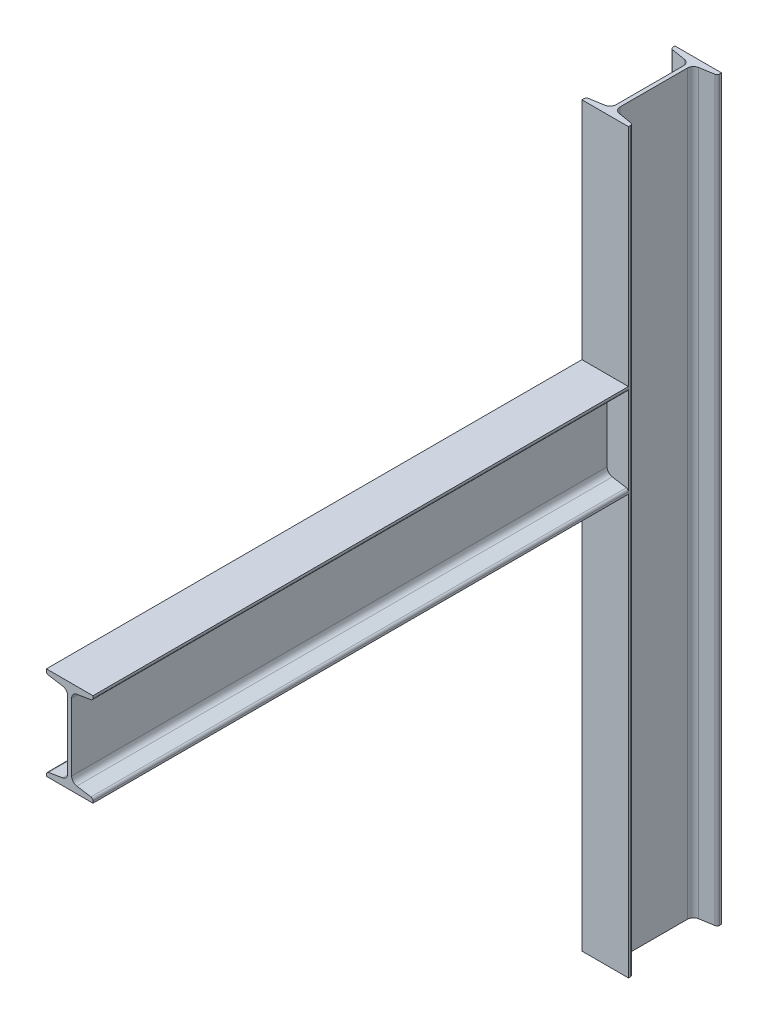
ISO-10303-21;
HEADER;
FILE_DESCRIPTION(('STEP AP214'),'2;1');
FILE_NAME('part.step','',(''),(''),'','','');
FILE_SCHEMA(('AUTOMOTIVE_DESIGN { 1 0 10303 214 1 1 1 1 }'));
ENDSEC;
DATA;
#1=APPLICATION_CONTEXT('core data for automotive mechanical design processes');
#2=APPLICATION_PROTOCOL_DEFINITION('international standard','automotive_design',2000,#1);
#3=PRODUCT_CONTEXT('',#1,'mechanical');
#4=PRODUCT('Part','Part','',(#3));
#5=PRODUCT_RELATED_PRODUCT_CATEGORY('part','',(#4));
#6=PRODUCT_DEFINITION_FORMATION('','',#4);
#7=PRODUCT_DEFINITION_CONTEXT('part definition',#1,'design');
#8=PRODUCT_DEFINITION('design','',#6,#7);
#9=PRODUCT_DEFINITION_SHAPE('','',#8);
#10=(LENGTH_UNIT() NAMED_UNIT(*) SI_UNIT(.MILLI.,.METRE.));
#11=(NAMED_UNIT(*) PLANE_ANGLE_UNIT() SI_UNIT($,.RADIAN.));
#12=(NAMED_UNIT(*) SI_UNIT($,.STERADIAN.) SOLID_ANGLE_UNIT());
#13=UNCERTAINTY_MEASURE_WITH_UNIT(LENGTH_MEASURE(1.E-05),#10,'distance_accuracy_value','');
#14=(GEOMETRIC_REPRESENTATION_CONTEXT(3) GLOBAL_UNCERTAINTY_ASSIGNED_CONTEXT((#13)) GLOBAL_UNIT_ASSIGNED_CONTEXT((#10,
#11,#12)) REPRESENTATION_CONTEXT('',''));
#15=CARTESIAN_POINT('',(0.,0.,0.));
#16=DIRECTION('',(0.,0.,1.));
#17=DIRECTION('',(1.,0.,0.));
#18=AXIS2_PLACEMENT_3D('',#15,#16,#17);
#19=CARTESIAN_POINT('',(-26.825,542.618569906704,750.));
#20=DIRECTION('',(0.,0.,-1.));
#21=DIRECTION('',(0.,1.,0.));
#22=AXIS2_PLACEMENT_3D('',#19,#20,#21);
#23=PLANE('',#22);
#24=DIRECTION('',(1.,0.,0.));
#25=VECTOR('',#24,1.);
#26=CARTESIAN_POINT('',(30.,540.,750.));
#27=LINE('',#26,#25);
#28=CARTESIAN_POINT('',(-30.,540.,750.));
#29=VERTEX_POINT('',#28);
#30=CARTESIAN_POINT('',(30.,540.,750.));
#31=VERTEX_POINT('',#30);
#32=EDGE_CURVE('E306',#29,#31,#27,.T.);
#33=ORIENTED_EDGE('',*,*,#32,.T.);
#34=DIRECTION('',(0.,1.,0.));
#35=VECTOR('',#34,1.);
#36=CARTESIAN_POINT('',(30.,542.618569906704,750.));
#37=LINE('',#36,#35);
#38=CARTESIAN_POINT('',(30.,542.618569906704,750.));
#39=VERTEX_POINT('',#38);
#40=EDGE_CURVE('E322',#31,#39,#37,.T.);
#41=ORIENTED_EDGE('',*,*,#40,.T.);
#42=CARTESIAN_POINT('',(26.825,542.618569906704,750.));
#43=DIRECTION('',(0.,0.,1.));
#44=DIRECTION('',(0.,-1.,0.));
#45=AXIS2_PLACEMENT_3D('',#42,#43,#44);
#46=CIRCLE('',#45,3.17500000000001);
#47=CARTESIAN_POINT('',(27.3470038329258,545.750364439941,750.));
#48=VERTEX_POINT('',#47);
#49=EDGE_CURVE('E330',#39,#48,#46,.T.);
#50=ORIENTED_EDGE('',*,*,#49,.T.);
#51=DIRECTION('',(-0.986391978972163,0.164410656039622,0.));
#52=VECTOR('',#51,1.);
#53=CARTESIAN_POINT('',(9.18471475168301,548.777633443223,750.));
#54=LINE('',#53,#52);
#55=CARTESIAN_POINT('',(9.18471475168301,548.777633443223,750.));
#56=VERTEX_POINT('',#55);
#57=EDGE_CURVE('E335',#48,#56,#54,.T.);
#58=ORIENTED_EDGE('',*,*,#57,.T.);
#59=CARTESIAN_POINT('',(10.5,556.668769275,750.));
#60=DIRECTION('',(0.,0.,-1.));
#61=DIRECTION('',(0.,-1.,0.));
#62=AXIS2_PLACEMENT_3D('',#59,#60,#61);
#63=CIRCLE('',#62,8.);
#64=CARTESIAN_POINT('',(2.49999999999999,556.668769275,750.));
#65=VERTEX_POINT('',#64);
#66=EDGE_CURVE('E340',#56,#65,#63,.T.);
#67=ORIENTED_EDGE('',*,*,#66,.T.);
#68=DIRECTION('',(0.,1.,0.));
#69=VECTOR('',#68,1.);
#70=CARTESIAN_POINT('',(2.49999999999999,643.331230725,750.));
#71=LINE('',#70,#69);
#72=CARTESIAN_POINT('',(2.5,643.331230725,750.));
#73=VERTEX_POINT('',#72);
#74=EDGE_CURVE('E345',#65,#73,#71,.T.);
#75=ORIENTED_EDGE('',*,*,#74,.T.);
#76=CARTESIAN_POINT('',(10.5,643.331230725,750.));
#77=DIRECTION('',(0.,0.,-1.));
#78=DIRECTION('',(0.,-1.,0.));
#79=AXIS2_PLACEMENT_3D('',#76,#77,#78);
#80=CIRCLE('',#79,8.00000000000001);
#81=CARTESIAN_POINT('',(9.18471475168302,651.222366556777,750.));
#82=VERTEX_POINT('',#81);
#83=EDGE_CURVE('E350',#73,#82,#80,.T.);
#84=ORIENTED_EDGE('',*,*,#83,.T.);
#85=DIRECTION('',(0.986391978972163,0.164410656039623,0.));
#86=VECTOR('',#85,1.);
#87=CARTESIAN_POINT('',(27.3470038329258,654.249635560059,750.));
#88=LINE('',#87,#86);
#89=CARTESIAN_POINT('',(27.3470038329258,654.249635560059,750.));
#90=VERTEX_POINT('',#89);
#91=EDGE_CURVE('E355',#82,#90,#88,.T.);
#92=ORIENTED_EDGE('',*,*,#91,.T.);
#93=CARTESIAN_POINT('',(26.825,657.381430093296,750.));
#94=DIRECTION('',(0.,0.,1.));
#95=DIRECTION('',(0.,-1.,0.));
#96=AXIS2_PLACEMENT_3D('',#93,#94,#95);
#97=CIRCLE('',#96,3.175);
#98=CARTESIAN_POINT('',(30.,657.381430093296,750.));
#99=VERTEX_POINT('',#98);
#100=EDGE_CURVE('E360',#90,#99,#97,.T.);
#101=ORIENTED_EDGE('',*,*,#100,.T.);
#102=DIRECTION('',(0.,1.,0.));
#103=VECTOR('',#102,1.);
#104=CARTESIAN_POINT('',(30.,660.,750.));
#105=LINE('',#104,#103);
#106=CARTESIAN_POINT('',(30.,660.,750.));
#107=VERTEX_POINT('',#106);
#108=EDGE_CURVE('E365',#99,#107,#105,.T.);
#109=ORIENTED_EDGE('',*,*,#108,.T.);
#110=DIRECTION('',(-1.,0.,0.));
#111=VECTOR('',#110,1.);
#112=CARTESIAN_POINT('',(-30.,660.,750.));
#113=LINE('',#112,#111);
#114=CARTESIAN_POINT('',(-30.,660.,750.));
#115=VERTEX_POINT('',#114);
#116=EDGE_CURVE('E370',#107,#115,#113,.T.);
#117=ORIENTED_EDGE('',*,*,#116,.T.);
#118=DIRECTION('',(0.,-1.,0.));
#119=VECTOR('',#118,1.);
#120=CARTESIAN_POINT('',(-30.,657.381430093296,750.));
#121=LINE('',#120,#119);
#122=CARTESIAN_POINT('',(-30.,657.381430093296,750.));
#123=VERTEX_POINT('',#122);
#124=EDGE_CURVE('E375',#115,#123,#121,.T.);
#125=ORIENTED_EDGE('',*,*,#124,.T.);
#126=CARTESIAN_POINT('',(-26.825,657.381430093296,750.));
#127=DIRECTION('',(0.,0.,1.));
#128=DIRECTION('',(0.,1.,0.));
#129=AXIS2_PLACEMENT_3D('',#126,#127,#128);
#130=CIRCLE('',#129,3.175);
#131=CARTESIAN_POINT('',(-27.3470038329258,654.249635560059,750.));
#132=VERTEX_POINT('',#131);
#133=EDGE_CURVE('E380',#123,#132,#130,.T.);
#134=ORIENTED_EDGE('',*,*,#133,.T.);
#135=DIRECTION('',(0.986391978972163,-0.164410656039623,0.));
#136=VECTOR('',#135,1.);
#137=CARTESIAN_POINT('',(-9.184714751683,651.222366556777,750.));
#138=LINE('',#137,#136);
#139=CARTESIAN_POINT('',(-9.184714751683,651.222366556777,750.));
#140=VERTEX_POINT('',#139);
#141=EDGE_CURVE('E385',#132,#140,#138,.T.);
#142=ORIENTED_EDGE('',*,*,#141,.T.);
#143=CARTESIAN_POINT('',(-10.5,643.331230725,750.));
#144=DIRECTION('',(0.,0.,-1.));
#145=DIRECTION('',(0.,-1.,0.));
#146=AXIS2_PLACEMENT_3D('',#143,#144,#145);
#147=CIRCLE('',#146,7.99999999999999);
#148=CARTESIAN_POINT('',(-2.50000000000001,643.331230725,750.));
#149=VERTEX_POINT('',#148);
#150=EDGE_CURVE('E390',#140,#149,#147,.T.);
#151=ORIENTED_EDGE('',*,*,#150,.T.);
#152=DIRECTION('',(0.,-1.,0.));
#153=VECTOR('',#152,1.);
#154=CARTESIAN_POINT('',(-2.50000000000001,556.668769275,750.));
#155=LINE('',#154,#153);
#156=CARTESIAN_POINT('',(-2.50000000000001,556.668769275,750.));
#157=VERTEX_POINT('',#156);
#158=EDGE_CURVE('E395',#149,#157,#155,.T.);
#159=ORIENTED_EDGE('',*,*,#158,.T.);
#160=CARTESIAN_POINT('',(-10.5,556.668769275,750.));
#161=DIRECTION('',(0.,0.,-1.));
#162=DIRECTION('',(0.,-1.,0.));
#163=AXIS2_PLACEMENT_3D('',#160,#161,#162);
#164=CIRCLE('',#163,8.);
#165=CARTESIAN_POINT('',(-9.18471475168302,548.777633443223,750.));
#166=VERTEX_POINT('',#165);
#167=EDGE_CURVE('E400',#157,#166,#164,.T.);
#168=ORIENTED_EDGE('',*,*,#167,.T.);
#169=DIRECTION('',(-0.986391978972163,-0.164410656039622,0.));
#170=VECTOR('',#169,1.);
#171=CARTESIAN_POINT('',(-27.3470038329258,545.750364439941,750.));
#172=LINE('',#171,#170);
#173=CARTESIAN_POINT('',(-27.3470038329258,545.750364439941,750.));
#174=VERTEX_POINT('',#173);
#175=EDGE_CURVE('E405',#166,#174,#172,.T.);
#176=ORIENTED_EDGE('',*,*,#175,.T.);
#177=CARTESIAN_POINT('',(-26.825,542.618569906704,750.));
#178=DIRECTION('',(0.,0.,1.));
#179=DIRECTION('',(0.,1.,0.));
#180=AXIS2_PLACEMENT_3D('',#177,#178,#179);
#181=CIRCLE('',#180,3.17499999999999);
#182=CARTESIAN_POINT('',(-30.,542.618569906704,750.));
#183=VERTEX_POINT('',#182);
#184=EDGE_CURVE('E315',#174,#183,#181,.T.);
#185=ORIENTED_EDGE('',*,*,#184,.T.);
#186=DIRECTION('',(0.,-1.,0.));
#187=VECTOR('',#186,1.);
#188=CARTESIAN_POINT('',(-30.,540.,750.));
#189=LINE('',#188,#187);
#190=EDGE_CURVE('E302',#183,#29,#189,.T.);
#191=ORIENTED_EDGE('',*,*,#190,.T.);
#192=EDGE_LOOP('',(#33,#41,#50,#58,#67,#75,#84,#92,#101,#109,#117,#125,#134,#142,#151,#159,#168,
#176,#185,#191));
#193=FACE_BOUND('',#192,.T.);
#194=ADVANCED_FACE('F164',(#193),#23,.F.);
#195=CARTESIAN_POINT('',(30.,540.,0.));
#196=DIRECTION('',(0.,-1.,0.));
#197=DIRECTION('',(1.,0.,0.));
#198=AXIS2_PLACEMENT_3D('',#195,#196,#197);
#199=PLANE('',#198);
#200=DIRECTION('',(-1.,0.,0.));
#201=VECTOR('',#200,1.);
#202=CARTESIAN_POINT('',(30.,540.,60.));
#203=LINE('',#202,#201);
#204=CARTESIAN_POINT('',(30.,540.,60.));
#205=VERTEX_POINT('',#204);
#206=CARTESIAN_POINT('',(-30.,540.,60.));
#207=VERTEX_POINT('',#206);
#208=EDGE_CURVE('E171',#205,#207,#203,.T.);
#209=ORIENTED_EDGE('',*,*,#208,.F.);
#210=DIRECTION('',(0.,0.,1.));
#211=VECTOR('',#210,1.);
#212=CARTESIAN_POINT('',(30.,540.,0.));
#213=LINE('',#212,#211);
#214=EDGE_CURVE('E320',#205,#31,#213,.T.);
#215=ORIENTED_EDGE('',*,*,#214,.T.);
#216=ORIENTED_EDGE('',*,*,#32,.F.);
#217=DIRECTION('',(0.,0.,1.));
#218=VECTOR('',#217,1.);
#219=CARTESIAN_POINT('',(-30.,540.,0.));
#220=LINE('',#219,#218);
#221=EDGE_CURVE('E298',#207,#29,#220,.T.);
#222=ORIENTED_EDGE('',*,*,#221,.F.);
#223=EDGE_LOOP('',(#209,#215,#216,#222));
#224=FACE_BOUND('',#223,.T.);
#225=ADVANCED_FACE('F318',(#224),#199,.T.);
#226=CARTESIAN_POINT('',(30.,542.618569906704,0.));
#227=DIRECTION('',(1.,0.,0.));
#228=DIRECTION('',(0.,1.,0.));
#229=AXIS2_PLACEMENT_3D('',#226,#227,#228);
#230=PLANE('',#229);
#231=DIRECTION('',(0.,-1.,0.));
#232=VECTOR('',#231,1.);
#233=CARTESIAN_POINT('',(30.,542.618569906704,60.));
#234=LINE('',#233,#232);
#235=CARTESIAN_POINT('',(30.,542.618569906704,60.));
#236=VERTEX_POINT('',#235);
#237=EDGE_CURVE('E446',#236,#205,#234,.T.);
#238=ORIENTED_EDGE('',*,*,#237,.F.);
#239=DIRECTION('',(0.,0.,1.));
#240=VECTOR('',#239,1.);
#241=CARTESIAN_POINT('',(30.,542.618569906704,0.));
#242=LINE('',#241,#240);
#243=EDGE_CURVE('E328',#236,#39,#242,.T.);
#244=ORIENTED_EDGE('',*,*,#243,.T.);
#245=ORIENTED_EDGE('',*,*,#40,.F.);
#246=ORIENTED_EDGE('',*,*,#214,.F.);
#247=EDGE_LOOP('',(#238,#244,#245,#246));
#248=FACE_BOUND('',#247,.T.);
#249=ADVANCED_FACE('F449',(#248),#230,.T.);
#250=CARTESIAN_POINT('',(26.825,542.618569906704,0.));
#251=DIRECTION('',(0.,0.,1.));
#252=DIRECTION('',(1.,0.,0.));
#253=AXIS2_PLACEMENT_3D('',#250,#251,#252);
#254=CYLINDRICAL_SURFACE('',#253,3.17500000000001);
#255=CARTESIAN_POINT('',(26.825,542.618569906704,60.));
#256=DIRECTION('',(0.,0.,1.));
#257=DIRECTION('',(1.,0.,0.));
#258=AXIS2_PLACEMENT_3D('',#255,#256,#257);
#259=CIRCLE('',#258,3.17500000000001);
#260=CARTESIAN_POINT('',(27.3470038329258,545.750364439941,60.));
#261=VERTEX_POINT('',#260);
#262=EDGE_CURVE('E178',#261,#236,#259,.F.);
#263=ORIENTED_EDGE('',*,*,#262,.F.);
#264=DIRECTION('',(0.,0.,1.));
#265=VECTOR('',#264,1.);
#266=CARTESIAN_POINT('',(27.3470038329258,545.750364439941,0.));
#267=LINE('',#266,#265);
#268=EDGE_CURVE('E333',#261,#48,#267,.T.);
#269=ORIENTED_EDGE('',*,*,#268,.T.);
#270=ORIENTED_EDGE('',*,*,#49,.F.);
#271=ORIENTED_EDGE('',*,*,#243,.F.);
#272=EDGE_LOOP('',(#263,#269,#270,#271));
#273=FACE_BOUND('',#272,.T.);
#274=ADVANCED_FACE('F454',(#273),#254,.T.);
#275=CARTESIAN_POINT('',(9.18471475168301,548.777633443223,0.));
#276=DIRECTION('',(0.164410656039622,0.986391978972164,0.));
#277=DIRECTION('',(-0.986391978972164,0.164410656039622,0.));
#278=AXIS2_PLACEMENT_3D('',#275,#276,#277);
#279=PLANE('',#278);
#280=DIRECTION('',(0.986391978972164,-0.164410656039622,0.));
#281=VECTOR('',#280,1.);
#282=CARTESIAN_POINT('',(9.18471475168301,548.777633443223,60.));
#283=LINE('',#282,#281);
#284=CARTESIAN_POINT('',(9.184714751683,548.777633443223,60.));
#285=VERTEX_POINT('',#284);
#286=EDGE_CURVE('E183',#285,#261,#283,.T.);
#287=ORIENTED_EDGE('',*,*,#286,.F.);
#288=DIRECTION('',(0.,0.,1.));
#289=VECTOR('',#288,1.);
#290=CARTESIAN_POINT('',(9.18471475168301,548.777633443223,0.));
#291=LINE('',#290,#289);
#292=EDGE_CURVE('E338',#285,#56,#291,.T.);
#293=ORIENTED_EDGE('',*,*,#292,.T.);
#294=ORIENTED_EDGE('',*,*,#57,.F.);
#295=ORIENTED_EDGE('',*,*,#268,.F.);
#296=EDGE_LOOP('',(#287,#293,#294,#295));
#297=FACE_BOUND('',#296,.T.);
#298=ADVANCED_FACE('F457',(#297),#279,.T.);
#299=CARTESIAN_POINT('',(10.5,556.668769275,0.));
#300=DIRECTION('',(0.,0.,1.));
#301=DIRECTION('',(1.,0.,0.));
#302=AXIS2_PLACEMENT_3D('',#299,#300,#301);
#303=CYLINDRICAL_SURFACE('',#302,8.);
#304=CARTESIAN_POINT('',(10.5,556.668769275,60.));
#305=DIRECTION('',(0.,0.,1.));
#306=DIRECTION('',(1.,0.,0.));
#307=AXIS2_PLACEMENT_3D('',#304,#305,#306);
#308=CIRCLE('',#307,8.);
#309=CARTESIAN_POINT('',(2.49999999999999,556.668769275,60.));
#310=VERTEX_POINT('',#309);
#311=EDGE_CURVE('E443',#310,#285,#308,.T.);
#312=ORIENTED_EDGE('',*,*,#311,.F.);
#313=DIRECTION('',(0.,0.,1.));
#314=VECTOR('',#313,1.);
#315=CARTESIAN_POINT('',(2.49999999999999,556.668769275,0.));
#316=LINE('',#315,#314);
#317=EDGE_CURVE('E343',#310,#65,#316,.T.);
#318=ORIENTED_EDGE('',*,*,#317,.T.);
#319=ORIENTED_EDGE('',*,*,#66,.F.);
#320=ORIENTED_EDGE('',*,*,#292,.F.);
#321=EDGE_LOOP('',(#312,#318,#319,#320));
#322=FACE_BOUND('',#321,.T.);
#323=ADVANCED_FACE('F463',(#322),#303,.F.);
#324=CARTESIAN_POINT('',(2.49999999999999,643.331230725,0.));
#325=DIRECTION('',(1.,0.,0.));
#326=DIRECTION('',(0.,0.,-1.));
#327=AXIS2_PLACEMENT_3D('',#324,#325,#326);
#328=PLANE('',#327);
#329=DIRECTION('',(0.,-1.,0.));
#330=VECTOR('',#329,1.);
#331=CARTESIAN_POINT('',(2.49999999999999,643.331230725,60.));
#332=LINE('',#331,#330);
#333=CARTESIAN_POINT('',(2.5,643.331230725,60.));
#334=VERTEX_POINT('',#333);
#335=EDGE_CURVE('E441',#334,#310,#332,.T.);
#336=ORIENTED_EDGE('',*,*,#335,.F.);
#337=DIRECTION('',(0.,0.,1.));
#338=VECTOR('',#337,1.);
#339=CARTESIAN_POINT('',(2.5,643.331230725,0.));
#340=LINE('',#339,#338);
#341=EDGE_CURVE('E348',#334,#73,#340,.T.);
#342=ORIENTED_EDGE('',*,*,#341,.T.);
#343=ORIENTED_EDGE('',*,*,#74,.F.);
#344=ORIENTED_EDGE('',*,*,#317,.F.);
#345=EDGE_LOOP('',(#336,#342,#343,#344));
#346=FACE_BOUND('',#345,.T.);
#347=ADVANCED_FACE('F467',(#346),#328,.T.);
#348=CARTESIAN_POINT('',(10.5,643.331230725,0.));
#349=DIRECTION('',(0.,0.,1.));
#350=DIRECTION('',(1.,0.,0.));
#351=AXIS2_PLACEMENT_3D('',#348,#349,#350);
#352=CYLINDRICAL_SURFACE('',#351,8.00000000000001);
#353=CARTESIAN_POINT('',(10.5,643.331230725,60.));
#354=DIRECTION('',(0.,0.,1.));
#355=DIRECTION('',(1.,0.,0.));
#356=AXIS2_PLACEMENT_3D('',#353,#354,#355);
#357=CIRCLE('',#356,8.00000000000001);
#358=CARTESIAN_POINT('',(9.18471475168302,651.222366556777,60.));
#359=VERTEX_POINT('',#358);
#360=EDGE_CURVE('E439',#359,#334,#357,.T.);
#361=ORIENTED_EDGE('',*,*,#360,.F.);
#362=DIRECTION('',(0.,0.,1.));
#363=VECTOR('',#362,1.);
#364=CARTESIAN_POINT('',(9.18471475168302,651.222366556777,0.));
#365=LINE('',#364,#363);
#366=EDGE_CURVE('E353',#359,#82,#365,.T.);
#367=ORIENTED_EDGE('',*,*,#366,.T.);
#368=ORIENTED_EDGE('',*,*,#83,.F.);
#369=ORIENTED_EDGE('',*,*,#341,.F.);
#370=EDGE_LOOP('',(#361,#367,#368,#369));
#371=FACE_BOUND('',#370,.T.);
#372=ADVANCED_FACE('F473',(#371),#352,.F.);
#373=CARTESIAN_POINT('',(27.3470038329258,654.249635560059,0.));
#374=DIRECTION('',(0.164410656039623,-0.986391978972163,0.));
#375=DIRECTION('',(0.986391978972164,0.164410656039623,0.));
#376=AXIS2_PLACEMENT_3D('',#373,#374,#375);
#377=PLANE('',#376);
#378=DIRECTION('',(-0.986391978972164,-0.164410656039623,0.));
#379=VECTOR('',#378,1.);
#380=CARTESIAN_POINT('',(27.3470038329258,654.249635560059,60.));
#381=LINE('',#380,#379);
#382=CARTESIAN_POINT('',(27.3470038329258,654.249635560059,60.));
#383=VERTEX_POINT('',#382);
#384=EDGE_CURVE('E437',#383,#359,#381,.T.);
#385=ORIENTED_EDGE('',*,*,#384,.F.);
#386=DIRECTION('',(0.,0.,1.));
#387=VECTOR('',#386,1.);
#388=CARTESIAN_POINT('',(27.3470038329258,654.249635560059,0.));
#389=LINE('',#388,#387);
#390=EDGE_CURVE('E358',#383,#90,#389,.T.);
#391=ORIENTED_EDGE('',*,*,#390,.T.);
#392=ORIENTED_EDGE('',*,*,#91,.F.);
#393=ORIENTED_EDGE('',*,*,#366,.F.);
#394=EDGE_LOOP('',(#385,#391,#392,#393));
#395=FACE_BOUND('',#394,.T.);
#396=ADVANCED_FACE('F477',(#395),#377,.T.);
#397=CARTESIAN_POINT('',(26.825,657.381430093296,0.));
#398=DIRECTION('',(0.,0.,1.));
#399=DIRECTION('',(1.,0.,0.));
#400=AXIS2_PLACEMENT_3D('',#397,#398,#399);
#401=CYLINDRICAL_SURFACE('',#400,3.175);
#402=CARTESIAN_POINT('',(26.825,657.381430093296,60.));
#403=DIRECTION('',(0.,0.,1.));
#404=DIRECTION('',(1.,0.,0.));
#405=AXIS2_PLACEMENT_3D('',#402,#403,#404);
#406=CIRCLE('',#405,3.175);
#407=CARTESIAN_POINT('',(30.,657.381430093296,60.));
#408=VERTEX_POINT('',#407);
#409=EDGE_CURVE('E435',#408,#383,#406,.F.);
#410=ORIENTED_EDGE('',*,*,#409,.F.);
#411=DIRECTION('',(0.,0.,1.));
#412=VECTOR('',#411,1.);
#413=CARTESIAN_POINT('',(30.,657.381430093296,0.));
#414=LINE('',#413,#412);
#415=EDGE_CURVE('E363',#408,#99,#414,.T.);
#416=ORIENTED_EDGE('',*,*,#415,.T.);
#417=ORIENTED_EDGE('',*,*,#100,.F.);
#418=ORIENTED_EDGE('',*,*,#390,.F.);
#419=EDGE_LOOP('',(#410,#416,#417,#418));
#420=FACE_BOUND('',#419,.T.);
#421=ADVANCED_FACE('F483',(#420),#401,.T.);
#422=CARTESIAN_POINT('',(30.,660.,0.));
#423=DIRECTION('',(1.,0.,0.));
#424=DIRECTION('',(0.,0.,-1.));
#425=AXIS2_PLACEMENT_3D('',#422,#423,#424);
#426=PLANE('',#425);
#427=DIRECTION('',(0.,-1.,0.));
#428=VECTOR('',#427,1.);
#429=CARTESIAN_POINT('',(30.,660.,60.));
#430=LINE('',#429,#428);
#431=CARTESIAN_POINT('',(30.,660.,60.));
#432=VERTEX_POINT('',#431);
#433=EDGE_CURVE('E433',#432,#408,#430,.T.);
#434=ORIENTED_EDGE('',*,*,#433,.F.);
#435=DIRECTION('',(0.,0.,1.));
#436=VECTOR('',#435,1.);
#437=CARTESIAN_POINT('',(30.,660.,0.));
#438=LINE('',#437,#436);
#439=EDGE_CURVE('E368',#432,#107,#438,.T.);
#440=ORIENTED_EDGE('',*,*,#439,.T.);
#441=ORIENTED_EDGE('',*,*,#108,.F.);
#442=ORIENTED_EDGE('',*,*,#415,.F.);
#443=EDGE_LOOP('',(#434,#440,#441,#442));
#444=FACE_BOUND('',#443,.T.);
#445=ADVANCED_FACE('F487',(#444),#426,.T.);
#446=CARTESIAN_POINT('',(-30.,660.,0.));
#447=DIRECTION('',(0.,1.,0.));
#448=DIRECTION('',(-1.,0.,0.));
#449=AXIS2_PLACEMENT_3D('',#446,#447,#448);
#450=PLANE('',#449);
#451=DIRECTION('',(1.,0.,0.));
#452=VECTOR('',#451,1.);
#453=CARTESIAN_POINT('',(-30.,660.,60.));
#454=LINE('',#453,#452);
#455=CARTESIAN_POINT('',(-30.,660.,60.));
#456=VERTEX_POINT('',#455);
#457=EDGE_CURVE('E431',#456,#432,#454,.T.);
#458=ORIENTED_EDGE('',*,*,#457,.F.);
#459=DIRECTION('',(0.,0.,1.));
#460=VECTOR('',#459,1.);
#461=CARTESIAN_POINT('',(-30.,660.,0.));
#462=LINE('',#461,#460);
#463=EDGE_CURVE('E373',#456,#115,#462,.T.);
#464=ORIENTED_EDGE('',*,*,#463,.T.);
#465=ORIENTED_EDGE('',*,*,#116,.F.);
#466=ORIENTED_EDGE('',*,*,#439,.F.);
#467=EDGE_LOOP('',(#458,#464,#465,#466));
#468=FACE_BOUND('',#467,.T.);
#469=ADVANCED_FACE('F493',(#468),#450,.T.);
#470=CARTESIAN_POINT('',(-30.,657.381430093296,0.));
#471=DIRECTION('',(-1.,0.,0.));
#472=DIRECTION('',(0.,0.,1.));
#473=AXIS2_PLACEMENT_3D('',#470,#471,#472);
#474=PLANE('',#473);
#475=DIRECTION('',(0.,1.,0.));
#476=VECTOR('',#475,1.);
#477=CARTESIAN_POINT('',(-30.,657.381430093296,60.));
#478=LINE('',#477,#476);
#479=CARTESIAN_POINT('',(-30.,657.381430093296,60.));
#480=VERTEX_POINT('',#479);
#481=EDGE_CURVE('E429',#480,#456,#478,.T.);
#482=ORIENTED_EDGE('',*,*,#481,.F.);
#483=DIRECTION('',(0.,0.,1.));
#484=VECTOR('',#483,1.);
#485=CARTESIAN_POINT('',(-30.,657.381430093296,0.));
#486=LINE('',#485,#484);
#487=EDGE_CURVE('E378',#480,#123,#486,.T.);
#488=ORIENTED_EDGE('',*,*,#487,.T.);
#489=ORIENTED_EDGE('',*,*,#124,.F.);
#490=ORIENTED_EDGE('',*,*,#463,.F.);
#491=EDGE_LOOP('',(#482,#488,#489,#490));
#492=FACE_BOUND('',#491,.T.);
#493=ADVANCED_FACE('F497',(#492),#474,.T.);
#494=CARTESIAN_POINT('',(-26.825,657.381430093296,0.));
#495=DIRECTION('',(0.,0.,1.));
#496=DIRECTION('',(1.,0.,0.));
#497=AXIS2_PLACEMENT_3D('',#494,#495,#496);
#498=CYLINDRICAL_SURFACE('',#497,3.175);
#499=CARTESIAN_POINT('',(-26.825,657.381430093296,60.));
#500=DIRECTION('',(0.,0.,1.));
#501=DIRECTION('',(1.,0.,0.));
#502=AXIS2_PLACEMENT_3D('',#499,#500,#501);
#503=CIRCLE('',#502,3.175);
#504=CARTESIAN_POINT('',(-27.3470038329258,654.249635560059,60.));
#505=VERTEX_POINT('',#504);
#506=EDGE_CURVE('E427',#505,#480,#503,.F.);
#507=ORIENTED_EDGE('',*,*,#506,.F.);
#508=DIRECTION('',(0.,0.,1.));
#509=VECTOR('',#508,1.);
#510=CARTESIAN_POINT('',(-27.3470038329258,654.249635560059,0.));
#511=LINE('',#510,#509);
#512=EDGE_CURVE('E383',#505,#132,#511,.T.);
#513=ORIENTED_EDGE('',*,*,#512,.T.);
#514=ORIENTED_EDGE('',*,*,#133,.F.);
#515=ORIENTED_EDGE('',*,*,#487,.F.);
#516=EDGE_LOOP('',(#507,#513,#514,#515));
#517=FACE_BOUND('',#516,.T.);
#518=ADVANCED_FACE('F503',(#517),#498,.T.);
#519=CARTESIAN_POINT('',(-9.184714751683,651.222366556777,0.));
#520=DIRECTION('',(-0.164410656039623,-0.986391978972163,0.));
#521=DIRECTION('',(0.986391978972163,-0.164410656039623,0.));
#522=AXIS2_PLACEMENT_3D('',#519,#520,#521);
#523=PLANE('',#522);
#524=DIRECTION('',(-0.986391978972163,0.164410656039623,0.));
#525=VECTOR('',#524,1.);
#526=CARTESIAN_POINT('',(-9.184714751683,651.222366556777,60.));
#527=LINE('',#526,#525);
#528=CARTESIAN_POINT('',(-9.18471475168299,651.222366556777,60.));
#529=VERTEX_POINT('',#528);
#530=EDGE_CURVE('E425',#529,#505,#527,.T.);
#531=ORIENTED_EDGE('',*,*,#530,.F.);
#532=DIRECTION('',(0.,0.,1.));
#533=VECTOR('',#532,1.);
#534=CARTESIAN_POINT('',(-9.184714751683,651.222366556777,0.));
#535=LINE('',#534,#533);
#536=EDGE_CURVE('E388',#529,#140,#535,.T.);
#537=ORIENTED_EDGE('',*,*,#536,.T.);
#538=ORIENTED_EDGE('',*,*,#141,.F.);
#539=ORIENTED_EDGE('',*,*,#512,.F.);
#540=EDGE_LOOP('',(#531,#537,#538,#539));
#541=FACE_BOUND('',#540,.T.);
#542=ADVANCED_FACE('F507',(#541),#523,.T.);
#543=CARTESIAN_POINT('',(-10.5,643.331230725,0.));
#544=DIRECTION('',(0.,0.,1.));
#545=DIRECTION('',(1.,0.,0.));
#546=AXIS2_PLACEMENT_3D('',#543,#544,#545);
#547=CYLINDRICAL_SURFACE('',#546,7.99999999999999);
#548=CARTESIAN_POINT('',(-10.5,643.331230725,60.));
#549=DIRECTION('',(0.,0.,1.));
#550=DIRECTION('',(1.,0.,0.));
#551=AXIS2_PLACEMENT_3D('',#548,#549,#550);
#552=CIRCLE('',#551,7.99999999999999);
#553=CARTESIAN_POINT('',(-2.50000000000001,643.331230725,60.));
#554=VERTEX_POINT('',#553);
#555=EDGE_CURVE('E423',#554,#529,#552,.T.);
#556=ORIENTED_EDGE('',*,*,#555,.F.);
#557=DIRECTION('',(0.,0.,1.));
#558=VECTOR('',#557,1.);
#559=CARTESIAN_POINT('',(-2.50000000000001,643.331230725,0.));
#560=LINE('',#559,#558);
#561=EDGE_CURVE('E393',#554,#149,#560,.T.);
#562=ORIENTED_EDGE('',*,*,#561,.T.);
#563=ORIENTED_EDGE('',*,*,#150,.F.);
#564=ORIENTED_EDGE('',*,*,#536,.F.);
#565=EDGE_LOOP('',(#556,#562,#563,#564));
#566=FACE_BOUND('',#565,.T.);
#567=ADVANCED_FACE('F513',(#566),#547,.F.);
#568=CARTESIAN_POINT('',(-2.50000000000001,556.668769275,0.));
#569=DIRECTION('',(-1.,0.,0.));
#570=DIRECTION('',(0.,0.,1.));
#571=AXIS2_PLACEMENT_3D('',#568,#569,#570);
#572=PLANE('',#571);
#573=DIRECTION('',(0.,1.,0.));
#574=VECTOR('',#573,1.);
#575=CARTESIAN_POINT('',(-2.50000000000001,556.668769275,60.));
#576=LINE('',#575,#574);
#577=CARTESIAN_POINT('',(-2.50000000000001,556.668769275,60.));
#578=VERTEX_POINT('',#577);
#579=EDGE_CURVE('E421',#578,#554,#576,.T.);
#580=ORIENTED_EDGE('',*,*,#579,.F.);
#581=DIRECTION('',(0.,0.,1.));
#582=VECTOR('',#581,1.);
#583=CARTESIAN_POINT('',(-2.50000000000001,556.668769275,0.));
#584=LINE('',#583,#582);
#585=EDGE_CURVE('E398',#578,#157,#584,.T.);
#586=ORIENTED_EDGE('',*,*,#585,.T.);
#587=ORIENTED_EDGE('',*,*,#158,.F.);
#588=ORIENTED_EDGE('',*,*,#561,.F.);
#589=EDGE_LOOP('',(#580,#586,#587,#588));
#590=FACE_BOUND('',#589,.T.);
#591=ADVANCED_FACE('F517',(#590),#572,.T.);
#592=CARTESIAN_POINT('',(-10.5,556.668769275,0.));
#593=DIRECTION('',(0.,0.,1.));
#594=DIRECTION('',(1.,0.,0.));
#595=AXIS2_PLACEMENT_3D('',#592,#593,#594);
#596=CYLINDRICAL_SURFACE('',#595,8.);
#597=CARTESIAN_POINT('',(-10.5,556.668769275,60.));
#598=DIRECTION('',(0.,0.,1.));
#599=DIRECTION('',(1.,0.,0.));
#600=AXIS2_PLACEMENT_3D('',#597,#598,#599);
#601=CIRCLE('',#600,8.);
#602=CARTESIAN_POINT('',(-9.18471475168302,548.777633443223,60.));
#603=VERTEX_POINT('',#602);
#604=EDGE_CURVE('E417',#603,#578,#601,.T.);
#605=ORIENTED_EDGE('',*,*,#604,.F.);
#606=DIRECTION('',(0.,0.,1.));
#607=VECTOR('',#606,1.);
#608=CARTESIAN_POINT('',(-9.18471475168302,548.777633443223,0.));
#609=LINE('',#608,#607);
#610=EDGE_CURVE('E403',#603,#166,#609,.T.);
#611=ORIENTED_EDGE('',*,*,#610,.T.);
#612=ORIENTED_EDGE('',*,*,#167,.F.);
#613=ORIENTED_EDGE('',*,*,#585,.F.);
#614=EDGE_LOOP('',(#605,#611,#612,#613));
#615=FACE_BOUND('',#614,.T.);
#616=ADVANCED_FACE('F523',(#615),#596,.F.);
#617=CARTESIAN_POINT('',(-27.3470038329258,545.750364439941,0.));
#618=DIRECTION('',(-0.164410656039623,0.986391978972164,0.));
#619=DIRECTION('',(-0.986391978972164,-0.164410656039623,0.));
#620=AXIS2_PLACEMENT_3D('',#617,#618,#619);
#621=PLANE('',#620);
#622=DIRECTION('',(0.986391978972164,0.164410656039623,0.));
#623=VECTOR('',#622,1.);
#624=CARTESIAN_POINT('',(-27.3470038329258,545.750364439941,60.));
#625=LINE('',#624,#623);
#626=CARTESIAN_POINT('',(-27.3470038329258,545.750364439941,60.));
#627=VERTEX_POINT('',#626);
#628=EDGE_CURVE('E415',#627,#603,#625,.T.);
#629=ORIENTED_EDGE('',*,*,#628,.F.);
#630=DIRECTION('',(0.,0.,1.));
#631=VECTOR('',#630,1.);
#632=CARTESIAN_POINT('',(-27.3470038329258,545.750364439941,0.));
#633=LINE('',#632,#631);
#634=EDGE_CURVE('E407',#627,#174,#633,.T.);
#635=ORIENTED_EDGE('',*,*,#634,.T.);
#636=ORIENTED_EDGE('',*,*,#175,.F.);
#637=ORIENTED_EDGE('',*,*,#610,.F.);
#638=EDGE_LOOP('',(#629,#635,#636,#637));
#639=FACE_BOUND('',#638,.T.);
#640=ADVANCED_FACE('F526',(#639),#621,.T.);
#641=CARTESIAN_POINT('',(-26.825,542.618569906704,0.));
#642=DIRECTION('',(0.,0.,1.));
#643=DIRECTION('',(1.,0.,0.));
#644=AXIS2_PLACEMENT_3D('',#641,#642,#643);
#645=CYLINDRICAL_SURFACE('',#644,3.17499999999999);
#646=CARTESIAN_POINT('',(-26.825,542.618569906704,60.));
#647=DIRECTION('',(0.,0.,1.));
#648=DIRECTION('',(1.,0.,0.));
#649=AXIS2_PLACEMENT_3D('',#646,#647,#648);
#650=CIRCLE('',#649,3.17499999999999);
#651=CARTESIAN_POINT('',(-30.,542.618569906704,60.));
#652=VERTEX_POINT('',#651);
#653=EDGE_CURVE('E316',#652,#627,#650,.F.);
#654=ORIENTED_EDGE('',*,*,#653,.F.);
#655=DIRECTION('',(0.,0.,1.));
#656=VECTOR('',#655,1.);
#657=CARTESIAN_POINT('',(-30.,542.618569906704,0.));
#658=LINE('',#657,#656);
#659=EDGE_CURVE('E317',#652,#183,#658,.T.);
#660=ORIENTED_EDGE('',*,*,#659,.T.);
#661=ORIENTED_EDGE('',*,*,#184,.F.);
#662=ORIENTED_EDGE('',*,*,#634,.F.);
#663=EDGE_LOOP('',(#654,#660,#661,#662));
#664=FACE_BOUND('',#663,.T.);
#665=ADVANCED_FACE('F412',(#664),#645,.T.);
#666=CARTESIAN_POINT('',(-30.,540.,0.));
#667=DIRECTION('',(-1.,0.,0.));
#668=DIRECTION('',(0.,0.,1.));
#669=AXIS2_PLACEMENT_3D('',#666,#667,#668);
#670=PLANE('',#669);
#671=DIRECTION('',(0.,1.,0.));
#672=VECTOR('',#671,1.);
#673=CARTESIAN_POINT('',(-30.,540.,60.));
#674=LINE('',#673,#672);
#675=EDGE_CURVE('E13',#207,#652,#674,.T.);
#676=ORIENTED_EDGE('',*,*,#675,.F.);
#677=ORIENTED_EDGE('',*,*,#221,.T.);
#678=ORIENTED_EDGE('',*,*,#190,.F.);
#679=ORIENTED_EDGE('',*,*,#659,.F.);
#680=EDGE_LOOP('',(#676,#677,#678,#679));
#681=FACE_BOUND('',#680,.T.);
#682=ADVANCED_FACE('F300',(#681),#670,.T.);
#683=CARTESIAN_POINT('',(0.,600.,60.));
#684=DIRECTION('',(0.,0.,1.));
#685=DIRECTION('',(1.,0.,0.));
#686=AXIS2_PLACEMENT_3D('',#683,#684,#685);
#687=PLANE('',#686);
#688=ORIENTED_EDGE('',*,*,#208,.T.);
#689=ORIENTED_EDGE('',*,*,#675,.T.);
#690=ORIENTED_EDGE('',*,*,#653,.T.);
#691=ORIENTED_EDGE('',*,*,#628,.T.);
#692=ORIENTED_EDGE('',*,*,#604,.T.);
#693=ORIENTED_EDGE('',*,*,#579,.T.);
#694=ORIENTED_EDGE('',*,*,#555,.T.);
#695=ORIENTED_EDGE('',*,*,#530,.T.);
#696=ORIENTED_EDGE('',*,*,#506,.T.);
#697=ORIENTED_EDGE('',*,*,#481,.T.);
#698=ORIENTED_EDGE('',*,*,#457,.T.);
#699=ORIENTED_EDGE('',*,*,#433,.T.);
#700=ORIENTED_EDGE('',*,*,#409,.T.);
#701=ORIENTED_EDGE('',*,*,#384,.T.);
#702=ORIENTED_EDGE('',*,*,#360,.T.);
#703=ORIENTED_EDGE('',*,*,#335,.T.);
#704=ORIENTED_EDGE('',*,*,#311,.T.);
#705=ORIENTED_EDGE('',*,*,#286,.T.);
#706=ORIENTED_EDGE('',*,*,#262,.T.);
#707=ORIENTED_EDGE('',*,*,#237,.T.);
#708=EDGE_LOOP('',(#688,#689,#690,#691,#692,#693,#694,#695,#696,#697,#698,#699,#700,#701,#702,
#703,#704,#705,#706,#707));
#709=FACE_BOUND('',#708,.T.);
#710=ADVANCED_FACE('F447',(#709),#687,.F.);
#711=CLOSED_SHELL('',(#194,#225,#249,#274,#298,#323,#347,#372,#396,#421,#445,#469,#493,#518,
#542,#567,#591,#616,#640,#665,#682,#710));
#712=MANIFOLD_SOLID_BREP('B2',#711);
#713=CARTESIAN_POINT('',(-26.825,0.,-57.3814300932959));
#714=DIRECTION('',(0.,1.,0.));
#715=DIRECTION('',(0.,0.,1.));
#716=AXIS2_PLACEMENT_3D('',#713,#714,#715);
#717=PLANE('',#716);
#718=DIRECTION('',(1.,0.,0.));
#719=VECTOR('',#718,1.);
#720=CARTESIAN_POINT('',(30.,0.,-60.));
#721=LINE('',#720,#719);
#722=CARTESIAN_POINT('',(-30.,0.,-60.));
#723=VERTEX_POINT('',#722);
#724=CARTESIAN_POINT('',(30.,0.,-60.));
#725=VERTEX_POINT('',#724);
#726=EDGE_CURVE('E1000',#723,#725,#721,.T.);
#727=ORIENTED_EDGE('',*,*,#726,.T.);
#728=DIRECTION('',(0.,0.,1.));
#729=VECTOR('',#728,1.);
#730=CARTESIAN_POINT('',(30.,0.,-57.3814300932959));
#731=LINE('',#730,#729);
#732=CARTESIAN_POINT('',(30.,0.,-57.3814300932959));
#733=VERTEX_POINT('',#732);
#734=EDGE_CURVE('E1007',#725,#733,#731,.T.);
#735=ORIENTED_EDGE('',*,*,#734,.T.);
#736=CARTESIAN_POINT('',(26.825,0.,-57.3814300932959));
#737=DIRECTION('',(0.,-1.,0.));
#738=DIRECTION('',(0.,0.,-1.));
#739=AXIS2_PLACEMENT_3D('',#736,#737,#738);
#740=CIRCLE('',#739,3.17500000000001);
#741=CARTESIAN_POINT('',(27.3470038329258,0.,-54.2496355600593));
#742=VERTEX_POINT('',#741);
#743=EDGE_CURVE('E1017',#733,#742,#740,.T.);
#744=ORIENTED_EDGE('',*,*,#743,.T.);
#745=DIRECTION('',(-0.986391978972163,0.,0.164410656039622));
#746=VECTOR('',#745,1.);
#747=CARTESIAN_POINT('',(9.18471475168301,0.,-51.2223665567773));
#748=LINE('',#747,#746);
#749=CARTESIAN_POINT('',(9.18471475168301,0.,-51.2223665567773));
#750=VERTEX_POINT('',#749);
#751=EDGE_CURVE('E1026',#742,#750,#748,.T.);
#752=ORIENTED_EDGE('',*,*,#751,.T.);
#753=CARTESIAN_POINT('',(10.5,0.,-43.331230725));
#754=DIRECTION('',(0.,1.,0.));
#755=DIRECTION('',(0.,0.,-1.));
#756=AXIS2_PLACEMENT_3D('',#753,#754,#755);
#757=CIRCLE('',#756,8.);
#758=CARTESIAN_POINT('',(2.49999999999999,0.,-43.331230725));
#759=VERTEX_POINT('',#758);
#760=EDGE_CURVE('E1034',#750,#759,#757,.T.);
#761=ORIENTED_EDGE('',*,*,#760,.T.);
#762=DIRECTION('',(0.,0.,1.));
#763=VECTOR('',#762,1.);
#764=CARTESIAN_POINT('',(2.49999999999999,0.,43.331230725));
#765=LINE('',#764,#763);
#766=CARTESIAN_POINT('',(2.5,0.,43.331230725));
#767=VERTEX_POINT('',#766);
#768=EDGE_CURVE('E1042',#759,#767,#765,.T.);
#769=ORIENTED_EDGE('',*,*,#768,.T.);
#770=CARTESIAN_POINT('',(10.5,0.,43.331230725));
#771=DIRECTION('',(0.,1.,0.));
#772=DIRECTION('',(0.,0.,-1.));
#773=AXIS2_PLACEMENT_3D('',#770,#771,#772);
#774=CIRCLE('',#773,8.00000000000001);
#775=CARTESIAN_POINT('',(9.18471475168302,0.,51.2223665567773));
#776=VERTEX_POINT('',#775);
#777=EDGE_CURVE('E1050',#767,#776,#774,.T.);
#778=ORIENTED_EDGE('',*,*,#777,.T.);
#779=DIRECTION('',(0.986391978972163,0.,0.164410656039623));
#780=VECTOR('',#779,1.);
#781=CARTESIAN_POINT('',(27.3470038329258,0.,54.2496355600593));
#782=LINE('',#781,#780);
#783=CARTESIAN_POINT('',(27.3470038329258,0.,54.2496355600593));
#784=VERTEX_POINT('',#783);
#785=EDGE_CURVE('E1058',#776,#784,#782,.T.);
#786=ORIENTED_EDGE('',*,*,#785,.T.);
#787=CARTESIAN_POINT('',(26.825,0.,57.3814300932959));
#788=DIRECTION('',(0.,-1.,0.));
#789=DIRECTION('',(0.,0.,-1.));
#790=AXIS2_PLACEMENT_3D('',#787,#788,#789);
#791=CIRCLE('',#790,3.175);
#792=CARTESIAN_POINT('',(30.,0.,57.3814300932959));
#793=VERTEX_POINT('',#792);
#794=EDGE_CURVE('E1066',#784,#793,#791,.T.);
#795=ORIENTED_EDGE('',*,*,#794,.T.);
#796=DIRECTION('',(0.,0.,1.));
#797=VECTOR('',#796,1.);
#798=CARTESIAN_POINT('',(30.,0.,60.));
#799=LINE('',#798,#797);
#800=CARTESIAN_POINT('',(30.,0.,60.));
#801=VERTEX_POINT('',#800);
#802=EDGE_CURVE('E1074',#793,#801,#799,.T.);
#803=ORIENTED_EDGE('',*,*,#802,.T.);
#804=DIRECTION('',(-1.,0.,0.));
#805=VECTOR('',#804,1.);
#806=CARTESIAN_POINT('',(-30.,0.,60.));
#807=LINE('',#806,#805);
#808=CARTESIAN_POINT('',(-30.,0.,60.));
#809=VERTEX_POINT('',#808);
#810=EDGE_CURVE('E1082',#801,#809,#807,.T.);
#811=ORIENTED_EDGE('',*,*,#810,.T.);
#812=DIRECTION('',(0.,0.,-1.));
#813=VECTOR('',#812,1.);
#814=CARTESIAN_POINT('',(-30.,0.,57.3814300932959));
#815=LINE('',#814,#813);
#816=CARTESIAN_POINT('',(-30.,0.,57.3814300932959));
#817=VERTEX_POINT('',#816);
#818=EDGE_CURVE('E1090',#809,#817,#815,.T.);
#819=ORIENTED_EDGE('',*,*,#818,.T.);
#820=CARTESIAN_POINT('',(-26.825,0.,57.3814300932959));
#821=DIRECTION('',(0.,-1.,0.));
#822=DIRECTION('',(0.,0.,1.));
#823=AXIS2_PLACEMENT_3D('',#820,#821,#822);
#824=CIRCLE('',#823,3.175);
#825=CARTESIAN_POINT('',(-27.3470038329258,0.,54.2496355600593));
#826=VERTEX_POINT('',#825);
#827=EDGE_CURVE('E1098',#817,#826,#824,.T.);
#828=ORIENTED_EDGE('',*,*,#827,.T.);
#829=DIRECTION('',(0.986391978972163,0.,-0.164410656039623));
#830=VECTOR('',#829,1.);
#831=CARTESIAN_POINT('',(-9.184714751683,0.,51.2223665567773));
#832=LINE('',#831,#830);
#833=CARTESIAN_POINT('',(-9.184714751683,0.,51.2223665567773));
#834=VERTEX_POINT('',#833);
#835=EDGE_CURVE('E1106',#826,#834,#832,.T.);
#836=ORIENTED_EDGE('',*,*,#835,.T.);
#837=CARTESIAN_POINT('',(-10.5,0.,43.331230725));
#838=DIRECTION('',(0.,1.,0.));
#839=DIRECTION('',(0.,0.,-1.));
#840=AXIS2_PLACEMENT_3D('',#837,#838,#839);
#841=CIRCLE('',#840,7.99999999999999);
#842=CARTESIAN_POINT('',(-2.50000000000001,0.,43.331230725));
#843=VERTEX_POINT('',#842);
#844=EDGE_CURVE('E1114',#834,#843,#841,.T.);
#845=ORIENTED_EDGE('',*,*,#844,.T.);
#846=DIRECTION('',(0.,0.,-1.));
#847=VECTOR('',#846,1.);
#848=CARTESIAN_POINT('',(-2.50000000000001,0.,-43.331230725));
#849=LINE('',#848,#847);
#850=CARTESIAN_POINT('',(-2.50000000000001,0.,-43.331230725));
#851=VERTEX_POINT('',#850);
#852=EDGE_CURVE('E1122',#843,#851,#849,.T.);
#853=ORIENTED_EDGE('',*,*,#852,.T.);
#854=CARTESIAN_POINT('',(-10.5,0.,-43.331230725));
#855=DIRECTION('',(0.,1.,0.));
#856=DIRECTION('',(0.,0.,-1.));
#857=AXIS2_PLACEMENT_3D('',#854,#855,#856);
#858=CIRCLE('',#857,8.);
#859=CARTESIAN_POINT('',(-9.18471475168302,0.,-51.2223665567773));
#860=VERTEX_POINT('',#859);
#861=EDGE_CURVE('E1130',#851,#860,#858,.T.);
#862=ORIENTED_EDGE('',*,*,#861,.T.);
#863=DIRECTION('',(-0.986391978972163,0.,-0.164410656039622));
#864=VECTOR('',#863,1.);
#865=CARTESIAN_POINT('',(-27.3470038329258,0.,-54.2496355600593));
#866=LINE('',#865,#864);
#867=CARTESIAN_POINT('',(-27.3470038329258,0.,-54.2496355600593));
#868=VERTEX_POINT('',#867);
#869=EDGE_CURVE('E898',#860,#868,#866,.T.);
#870=ORIENTED_EDGE('',*,*,#869,.T.);
#871=CARTESIAN_POINT('',(-26.825,0.,-57.3814300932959));
#872=DIRECTION('',(0.,-1.,0.));
#873=DIRECTION('',(0.,0.,1.));
#874=AXIS2_PLACEMENT_3D('',#871,#872,#873);
#875=CIRCLE('',#874,3.17499999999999);
#876=CARTESIAN_POINT('',(-30.,0.,-57.3814300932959));
#877=VERTEX_POINT('',#876);
#878=EDGE_CURVE('E893',#868,#877,#875,.T.);
#879=ORIENTED_EDGE('',*,*,#878,.T.);
#880=DIRECTION('',(0.,0.,-1.));
#881=VECTOR('',#880,1.);
#882=CARTESIAN_POINT('',(-30.,0.,-60.));
#883=LINE('',#882,#881);
#884=EDGE_CURVE('E887',#877,#723,#883,.T.);
#885=ORIENTED_EDGE('',*,*,#884,.T.);
#886=EDGE_LOOP('',(#727,#735,#744,#752,#761,#769,#778,#786,#795,#803,#811,#819,#828,#836,#845,
#853,#862,#870,#879,#885));
#887=FACE_BOUND('',#886,.T.);
#888=ADVANCED_FACE('F851',(#887),#717,.F.);
#889=CARTESIAN_POINT('',(-26.825,950.,-57.3814300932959));
#890=DIRECTION('',(0.,1.,0.));
#891=DIRECTION('',(0.,0.,1.));
#892=AXIS2_PLACEMENT_3D('',#889,#890,#891);
#893=PLANE('',#892);
#894=DIRECTION('',(1.,0.,0.));
#895=VECTOR('',#894,1.);
#896=CARTESIAN_POINT('',(30.,950.,-60.));
#897=LINE('',#896,#895);
#898=CARTESIAN_POINT('',(-30.,950.,-60.));
#899=VERTEX_POINT('',#898);
#900=CARTESIAN_POINT('',(30.,950.,-60.));
#901=VERTEX_POINT('',#900);
#902=EDGE_CURVE('E1011',#899,#901,#897,.T.);
#903=ORIENTED_EDGE('',*,*,#902,.F.);
#904=DIRECTION('',(0.,0.,-1.));
#905=VECTOR('',#904,1.);
#906=CARTESIAN_POINT('',(-30.,950.,-60.));
#907=LINE('',#906,#905);
#908=CARTESIAN_POINT('',(-30.,950.,-57.3814300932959));
#909=VERTEX_POINT('',#908);
#910=EDGE_CURVE('E162',#909,#899,#907,.T.);
#911=ORIENTED_EDGE('',*,*,#910,.F.);
#912=CARTESIAN_POINT('',(-26.825,950.,-57.3814300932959));
#913=DIRECTION('',(0.,-1.,0.));
#914=DIRECTION('',(0.,0.,1.));
#915=AXIS2_PLACEMENT_3D('',#912,#913,#914);
#916=CIRCLE('',#915,3.17499999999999);
#917=CARTESIAN_POINT('',(-27.3470038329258,950.,-54.2496355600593));
#918=VERTEX_POINT('',#917);
#919=EDGE_CURVE('E865',#918,#909,#916,.T.);
#920=ORIENTED_EDGE('',*,*,#919,.F.);
#921=DIRECTION('',(-0.986391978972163,0.,-0.164410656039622));
#922=VECTOR('',#921,1.);
#923=CARTESIAN_POINT('',(-27.3470038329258,950.,-54.2496355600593));
#924=LINE('',#923,#922);
#925=CARTESIAN_POINT('',(-9.18471475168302,950.,-51.2223665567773));
#926=VERTEX_POINT('',#925);
#927=EDGE_CURVE('E874',#926,#918,#924,.T.);
#928=ORIENTED_EDGE('',*,*,#927,.F.);
#929=CARTESIAN_POINT('',(-10.5,950.,-43.331230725));
#930=DIRECTION('',(0.,1.,0.));
#931=DIRECTION('',(0.,0.,-1.));
#932=AXIS2_PLACEMENT_3D('',#929,#930,#931);
#933=CIRCLE('',#932,8.);
#934=CARTESIAN_POINT('',(-2.50000000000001,950.,-43.331230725));
#935=VERTEX_POINT('',#934);
#936=EDGE_CURVE('E1135',#935,#926,#933,.T.);
#937=ORIENTED_EDGE('',*,*,#936,.F.);
#938=DIRECTION('',(0.,0.,-1.));
#939=VECTOR('',#938,1.);
#940=CARTESIAN_POINT('',(-2.50000000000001,950.,-43.331230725));
#941=LINE('',#940,#939);
#942=CARTESIAN_POINT('',(-2.50000000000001,950.,43.331230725));
#943=VERTEX_POINT('',#942);
#944=EDGE_CURVE('E1127',#943,#935,#941,.T.);
#945=ORIENTED_EDGE('',*,*,#944,.F.);
#946=CARTESIAN_POINT('',(-10.5,950.,43.331230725));
#947=DIRECTION('',(0.,1.,0.));
#948=DIRECTION('',(0.,0.,-1.));
#949=AXIS2_PLACEMENT_3D('',#946,#947,#948);
#950=CIRCLE('',#949,7.99999999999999);
#951=CARTESIAN_POINT('',(-9.184714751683,950.,51.2223665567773));
#952=VERTEX_POINT('',#951);
#953=EDGE_CURVE('E1119',#952,#943,#950,.T.);
#954=ORIENTED_EDGE('',*,*,#953,.F.);
#955=DIRECTION('',(0.986391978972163,0.,-0.164410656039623));
#956=VECTOR('',#955,1.);
#957=CARTESIAN_POINT('',(-9.184714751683,950.,51.2223665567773));
#958=LINE('',#957,#956);
#959=CARTESIAN_POINT('',(-27.3470038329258,950.,54.2496355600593));
#960=VERTEX_POINT('',#959);
#961=EDGE_CURVE('E1111',#960,#952,#958,.T.);
#962=ORIENTED_EDGE('',*,*,#961,.F.);
#963=CARTESIAN_POINT('',(-26.825,950.,57.3814300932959));
#964=DIRECTION('',(0.,-1.,0.));
#965=DIRECTION('',(0.,0.,1.));
#966=AXIS2_PLACEMENT_3D('',#963,#964,#965);
#967=CIRCLE('',#966,3.175);
#968=CARTESIAN_POINT('',(-30.,950.,57.3814300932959));
#969=VERTEX_POINT('',#968);
#970=EDGE_CURVE('E1103',#969,#960,#967,.T.);
#971=ORIENTED_EDGE('',*,*,#970,.F.);
#972=DIRECTION('',(0.,0.,-1.));
#973=VECTOR('',#972,1.);
#974=CARTESIAN_POINT('',(-30.,950.,57.3814300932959));
#975=LINE('',#974,#973);
#976=CARTESIAN_POINT('',(-30.,950.,60.));
#977=VERTEX_POINT('',#976);
#978=EDGE_CURVE('E1095',#977,#969,#975,.T.);
#979=ORIENTED_EDGE('',*,*,#978,.F.);
#980=DIRECTION('',(-1.,0.,0.));
#981=VECTOR('',#980,1.);
#982=CARTESIAN_POINT('',(-30.,950.,60.));
#983=LINE('',#982,#981);
#984=CARTESIAN_POINT('',(30.,950.,60.));
#985=VERTEX_POINT('',#984);
#986=EDGE_CURVE('E1087',#985,#977,#983,.T.);
#987=ORIENTED_EDGE('',*,*,#986,.F.);
#988=DIRECTION('',(0.,0.,1.));
#989=VECTOR('',#988,1.);
#990=CARTESIAN_POINT('',(30.,950.,60.));
#991=LINE('',#990,#989);
#992=CARTESIAN_POINT('',(30.,950.,57.3814300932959));
#993=VERTEX_POINT('',#992);
#994=EDGE_CURVE('E1079',#993,#985,#991,.T.);
#995=ORIENTED_EDGE('',*,*,#994,.F.);
#996=CARTESIAN_POINT('',(26.825,950.,57.3814300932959));
#997=DIRECTION('',(0.,-1.,0.));
#998=DIRECTION('',(0.,0.,-1.));
#999=AXIS2_PLACEMENT_3D('',#996,#997,#998);
#1000=CIRCLE('',#999,3.175);
#1001=CARTESIAN_POINT('',(27.3470038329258,950.,54.2496355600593));
#1002=VERTEX_POINT('',#1001);
#1003=EDGE_CURVE('E1071',#1002,#993,#1000,.T.);
#1004=ORIENTED_EDGE('',*,*,#1003,.F.);
#1005=DIRECTION('',(0.986391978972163,0.,0.164410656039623));
#1006=VECTOR('',#1005,1.);
#1007=CARTESIAN_POINT('',(27.3470038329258,950.,54.2496355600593));
#1008=LINE('',#1007,#1006);
#1009=CARTESIAN_POINT('',(9.18471475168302,950.,51.2223665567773));
#1010=VERTEX_POINT('',#1009);
#1011=EDGE_CURVE('E1063',#1010,#1002,#1008,.T.);
#1012=ORIENTED_EDGE('',*,*,#1011,.F.);
#1013=CARTESIAN_POINT('',(10.5,950.,43.331230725));
#1014=DIRECTION('',(0.,1.,0.));
#1015=DIRECTION('',(0.,0.,-1.));
#1016=AXIS2_PLACEMENT_3D('',#1013,#1014,#1015);
#1017=CIRCLE('',#1016,8.00000000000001);
#1018=CARTESIAN_POINT('',(2.5,950.,43.331230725));
#1019=VERTEX_POINT('',#1018);
#1020=EDGE_CURVE('E1055',#1019,#1010,#1017,.T.);
#1021=ORIENTED_EDGE('',*,*,#1020,.F.);
#1022=DIRECTION('',(0.,0.,1.));
#1023=VECTOR('',#1022,1.);
#1024=CARTESIAN_POINT('',(2.49999999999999,950.,43.331230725));
#1025=LINE('',#1024,#1023);
#1026=CARTESIAN_POINT('',(2.49999999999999,950.,-43.331230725));
#1027=VERTEX_POINT('',#1026);
#1028=EDGE_CURVE('E1047',#1027,#1019,#1025,.T.);
#1029=ORIENTED_EDGE('',*,*,#1028,.F.);
#1030=CARTESIAN_POINT('',(10.5,950.,-43.331230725));
#1031=DIRECTION('',(0.,1.,0.));
#1032=DIRECTION('',(0.,0.,-1.));
#1033=AXIS2_PLACEMENT_3D('',#1030,#1031,#1032);
#1034=CIRCLE('',#1033,8.);
#1035=CARTESIAN_POINT('',(9.18471475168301,950.,-51.2223665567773));
#1036=VERTEX_POINT('',#1035);
#1037=EDGE_CURVE('E1039',#1036,#1027,#1034,.T.);
#1038=ORIENTED_EDGE('',*,*,#1037,.F.);
#1039=DIRECTION('',(-0.986391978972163,0.,0.164410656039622));
#1040=VECTOR('',#1039,1.);
#1041=CARTESIAN_POINT('',(9.18471475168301,950.,-51.2223665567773));
#1042=LINE('',#1041,#1040);
#1043=CARTESIAN_POINT('',(27.3470038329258,950.,-54.2496355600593));
#1044=VERTEX_POINT('',#1043);
#1045=EDGE_CURVE('E1031',#1044,#1036,#1042,.T.);
#1046=ORIENTED_EDGE('',*,*,#1045,.F.);
#1047=CARTESIAN_POINT('',(26.825,950.,-57.3814300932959));
#1048=DIRECTION('',(0.,-1.,0.));
#1049=DIRECTION('',(0.,0.,-1.));
#1050=AXIS2_PLACEMENT_3D('',#1047,#1048,#1049);
#1051=CIRCLE('',#1050,3.17500000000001);
#1052=CARTESIAN_POINT('',(30.,950.,-57.3814300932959));
#1053=VERTEX_POINT('',#1052);
#1054=EDGE_CURVE('E1023',#1053,#1044,#1051,.T.);
#1055=ORIENTED_EDGE('',*,*,#1054,.F.);
#1056=DIRECTION('',(0.,0.,1.));
#1057=VECTOR('',#1056,1.);
#1058=CARTESIAN_POINT('',(30.,950.,-57.3814300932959));
#1059=LINE('',#1058,#1057);
#1060=EDGE_CURVE('E1018',#901,#1053,#1059,.T.);
#1061=ORIENTED_EDGE('',*,*,#1060,.F.);
#1062=EDGE_LOOP('',(#903,#911,#920,#928,#937,#945,#954,#962,#971,#979,#987,#995,#1004,#1012,
#1021,#1029,#1038,#1046,#1055,#1061));
#1063=FACE_BOUND('',#1062,.T.);
#1064=ADVANCED_FACE('F1158',(#1063),#893,.T.);
#1065=CARTESIAN_POINT('',(30.,0.,-60.));
#1066=DIRECTION('',(0.,0.,1.));
#1067=DIRECTION('',(1.,0.,0.));
#1068=AXIS2_PLACEMENT_3D('',#1065,#1066,#1067);
#1069=PLANE('',#1068);
#1070=DIRECTION('',(0.,1.,0.));
#1071=VECTOR('',#1070,1.);
#1072=CARTESIAN_POINT('',(30.,0.,-60.));
#1073=LINE('',#1072,#1071);
#1074=EDGE_CURVE('E1004',#725,#901,#1073,.T.);
#1075=ORIENTED_EDGE('',*,*,#1074,.F.);
#1076=ORIENTED_EDGE('',*,*,#726,.F.);
#1077=DIRECTION('',(0.,1.,0.));
#1078=VECTOR('',#1077,1.);
#1079=CARTESIAN_POINT('',(-30.,0.,-60.));
#1080=LINE('',#1079,#1078);
#1081=EDGE_CURVE('E1002',#723,#899,#1080,.T.);
#1082=ORIENTED_EDGE('',*,*,#1081,.T.);
#1083=ORIENTED_EDGE('',*,*,#902,.T.);
#1084=EDGE_LOOP('',(#1075,#1076,#1082,#1083));
#1085=FACE_BOUND('',#1084,.T.);
#1086=ADVANCED_FACE('F1001',(#1085),#1069,.F.);
#1087=CARTESIAN_POINT('',(30.,0.,-57.3814300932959));
#1088=DIRECTION('',(-1.,0.,0.));
#1089=DIRECTION('',(0.,0.,1.));
#1090=AXIS2_PLACEMENT_3D('',#1087,#1088,#1089);
#1091=PLANE('',#1090);
#1092=DIRECTION('',(0.,1.,0.));
#1093=VECTOR('',#1092,1.);
#1094=CARTESIAN_POINT('',(30.,0.,-57.3814300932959));
#1095=LINE('',#1094,#1093);
#1096=EDGE_CURVE('E1020',#733,#1053,#1095,.T.);
#1097=ORIENTED_EDGE('',*,*,#1096,.F.);
#1098=ORIENTED_EDGE('',*,*,#734,.F.);
#1099=ORIENTED_EDGE('',*,*,#1074,.T.);
#1100=ORIENTED_EDGE('',*,*,#1060,.T.);
#1101=EDGE_LOOP('',(#1097,#1098,#1099,#1100));
#1102=FACE_BOUND('',#1101,.T.);
#1103=ADVANCED_FACE('F1165',(#1102),#1091,.F.);
#1104=CARTESIAN_POINT('',(26.825,0.,-57.3814300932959));
#1105=DIRECTION('',(0.,1.,0.));
#1106=DIRECTION('',(0.,0.,1.));
#1107=AXIS2_PLACEMENT_3D('',#1104,#1105,#1106);
#1108=CYLINDRICAL_SURFACE('',#1107,3.17500000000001);
#1109=DIRECTION('',(0.,1.,0.));
#1110=VECTOR('',#1109,1.);
#1111=CARTESIAN_POINT('',(27.3470038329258,0.,-54.2496355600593));
#1112=LINE('',#1111,#1110);
#1113=EDGE_CURVE('E1028',#742,#1044,#1112,.T.);
#1114=ORIENTED_EDGE('',*,*,#1113,.F.);
#1115=ORIENTED_EDGE('',*,*,#743,.F.);
#1116=ORIENTED_EDGE('',*,*,#1096,.T.);
#1117=ORIENTED_EDGE('',*,*,#1054,.T.);
#1118=EDGE_LOOP('',(#1114,#1115,#1116,#1117));
#1119=FACE_BOUND('',#1118,.T.);
#1120=ADVANCED_FACE('F1175',(#1119),#1108,.T.);
#1121=CARTESIAN_POINT('',(9.18471475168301,0.,-51.2223665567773));
#1122=DIRECTION('',(-0.164410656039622,0.,-0.986391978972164));
#1123=DIRECTION('',(-0.986391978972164,0.,0.164410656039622));
#1124=AXIS2_PLACEMENT_3D('',#1121,#1122,#1123);
#1125=PLANE('',#1124);
#1126=DIRECTION('',(0.,1.,0.));
#1127=VECTOR('',#1126,1.);
#1128=CARTESIAN_POINT('',(9.18471475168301,0.,-51.2223665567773));
#1129=LINE('',#1128,#1127);
#1130=EDGE_CURVE('E1036',#750,#1036,#1129,.T.);
#1131=ORIENTED_EDGE('',*,*,#1130,.F.);
#1132=ORIENTED_EDGE('',*,*,#751,.F.);
#1133=ORIENTED_EDGE('',*,*,#1113,.T.);
#1134=ORIENTED_EDGE('',*,*,#1045,.T.);
#1135=EDGE_LOOP('',(#1131,#1132,#1133,#1134));
#1136=FACE_BOUND('',#1135,.T.);
#1137=ADVANCED_FACE('F1177',(#1136),#1125,.F.);
#1138=CARTESIAN_POINT('',(10.5,0.,-43.331230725));
#1139=DIRECTION('',(0.,1.,0.));
#1140=DIRECTION('',(0.,0.,1.));
#1141=AXIS2_PLACEMENT_3D('',#1138,#1139,#1140);
#1142=CYLINDRICAL_SURFACE('',#1141,8.);
#1143=DIRECTION('',(0.,1.,0.));
#1144=VECTOR('',#1143,1.);
#1145=CARTESIAN_POINT('',(2.49999999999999,0.,-43.331230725));
#1146=LINE('',#1145,#1144);
#1147=EDGE_CURVE('E1044',#759,#1027,#1146,.T.);
#1148=ORIENTED_EDGE('',*,*,#1147,.F.);
#1149=ORIENTED_EDGE('',*,*,#760,.F.);
#1150=ORIENTED_EDGE('',*,*,#1130,.T.);
#1151=ORIENTED_EDGE('',*,*,#1037,.T.);
#1152=EDGE_LOOP('',(#1148,#1149,#1150,#1151));
#1153=FACE_BOUND('',#1152,.T.);
#1154=ADVANCED_FACE('F1181',(#1153),#1142,.F.);
#1155=CARTESIAN_POINT('',(2.49999999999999,0.,43.331230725));
#1156=DIRECTION('',(-1.,0.,0.));
#1157=DIRECTION('',(0.,0.,1.));
#1158=AXIS2_PLACEMENT_3D('',#1155,#1156,#1157);
#1159=PLANE('',#1158);
#1160=DIRECTION('',(0.,1.,0.));
#1161=VECTOR('',#1160,1.);
#1162=CARTESIAN_POINT('',(2.5,0.,43.331230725));
#1163=LINE('',#1162,#1161);
#1164=EDGE_CURVE('E1052',#767,#1019,#1163,.T.);
#1165=ORIENTED_EDGE('',*,*,#1164,.F.);
#1166=ORIENTED_EDGE('',*,*,#768,.F.);
#1167=ORIENTED_EDGE('',*,*,#1147,.T.);
#1168=ORIENTED_EDGE('',*,*,#1028,.T.);
#1169=EDGE_LOOP('',(#1165,#1166,#1167,#1168));
#1170=FACE_BOUND('',#1169,.T.);
#1171=ADVANCED_FACE('F1186',(#1170),#1159,.F.);
#1172=CARTESIAN_POINT('',(10.5,0.,43.331230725));
#1173=DIRECTION('',(0.,1.,0.));
#1174=DIRECTION('',(0.,0.,1.));
#1175=AXIS2_PLACEMENT_3D('',#1172,#1173,#1174);
#1176=CYLINDRICAL_SURFACE('',#1175,8.00000000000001);
#1177=DIRECTION('',(0.,1.,0.));
#1178=VECTOR('',#1177,1.);
#1179=CARTESIAN_POINT('',(9.18471475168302,0.,51.2223665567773));
#1180=LINE('',#1179,#1178);
#1181=EDGE_CURVE('E1060',#776,#1010,#1180,.T.);
#1182=ORIENTED_EDGE('',*,*,#1181,.F.);
#1183=ORIENTED_EDGE('',*,*,#777,.F.);
#1184=ORIENTED_EDGE('',*,*,#1164,.T.);
#1185=ORIENTED_EDGE('',*,*,#1020,.T.);
#1186=EDGE_LOOP('',(#1182,#1183,#1184,#1185));
#1187=FACE_BOUND('',#1186,.T.);
#1188=ADVANCED_FACE('F1189',(#1187),#1176,.F.);
#1189=CARTESIAN_POINT('',(27.3470038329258,0.,54.2496355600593));
#1190=DIRECTION('',(-0.164410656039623,0.,0.986391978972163));
#1191=DIRECTION('',(0.986391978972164,0.,0.164410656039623));
#1192=AXIS2_PLACEMENT_3D('',#1189,#1190,#1191);
#1193=PLANE('',#1192);
#1194=DIRECTION('',(0.,1.,0.));
#1195=VECTOR('',#1194,1.);
#1196=CARTESIAN_POINT('',(27.3470038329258,0.,54.2496355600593));
#1197=LINE('',#1196,#1195);
#1198=EDGE_CURVE('E1068',#784,#1002,#1197,.T.);
#1199=ORIENTED_EDGE('',*,*,#1198,.F.);
#1200=ORIENTED_EDGE('',*,*,#785,.F.);
#1201=ORIENTED_EDGE('',*,*,#1181,.T.);
#1202=ORIENTED_EDGE('',*,*,#1011,.T.);
#1203=EDGE_LOOP('',(#1199,#1200,#1201,#1202));
#1204=FACE_BOUND('',#1203,.T.);
#1205=ADVANCED_FACE('F1193',(#1204),#1193,.F.);
#1206=CARTESIAN_POINT('',(26.825,0.,57.3814300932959));
#1207=DIRECTION('',(0.,1.,0.));
#1208=DIRECTION('',(0.,0.,1.));
#1209=AXIS2_PLACEMENT_3D('',#1206,#1207,#1208);
#1210=CYLINDRICAL_SURFACE('',#1209,3.175);
#1211=DIRECTION('',(0.,1.,0.));
#1212=VECTOR('',#1211,1.);
#1213=CARTESIAN_POINT('',(30.,0.,57.3814300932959));
#1214=LINE('',#1213,#1212);
#1215=EDGE_CURVE('E1076',#793,#993,#1214,.T.);
#1216=ORIENTED_EDGE('',*,*,#1215,.F.);
#1217=ORIENTED_EDGE('',*,*,#794,.F.);
#1218=ORIENTED_EDGE('',*,*,#1198,.T.);
#1219=ORIENTED_EDGE('',*,*,#1003,.T.);
#1220=EDGE_LOOP('',(#1216,#1217,#1218,#1219));
#1221=FACE_BOUND('',#1220,.T.);
#1222=ADVANCED_FACE('F1198',(#1221),#1210,.T.);
#1223=CARTESIAN_POINT('',(30.,0.,60.));
#1224=DIRECTION('',(-1.,0.,0.));
#1225=DIRECTION('',(0.,0.,1.));
#1226=AXIS2_PLACEMENT_3D('',#1223,#1224,#1225);
#1227=PLANE('',#1226);
#1228=DIRECTION('',(0.,1.,0.));
#1229=VECTOR('',#1228,1.);
#1230=CARTESIAN_POINT('',(30.,0.,60.));
#1231=LINE('',#1230,#1229);
#1232=EDGE_CURVE('E1084',#801,#985,#1231,.T.);
#1233=ORIENTED_EDGE('',*,*,#1232,.F.);
#1234=ORIENTED_EDGE('',*,*,#802,.F.);
#1235=ORIENTED_EDGE('',*,*,#1215,.T.);
#1236=ORIENTED_EDGE('',*,*,#994,.T.);
#1237=EDGE_LOOP('',(#1233,#1234,#1235,#1236));
#1238=FACE_BOUND('',#1237,.T.);
#1239=ADVANCED_FACE('F1201',(#1238),#1227,.F.);
#1240=CARTESIAN_POINT('',(-30.,0.,60.));
#1241=DIRECTION('',(0.,0.,-1.));
#1242=DIRECTION('',(-1.,0.,0.));
#1243=AXIS2_PLACEMENT_3D('',#1240,#1241,#1242);
#1244=PLANE('',#1243);
#1245=DIRECTION('',(0.,1.,0.));
#1246=VECTOR('',#1245,1.);
#1247=CARTESIAN_POINT('',(-30.,0.,60.));
#1248=LINE('',#1247,#1246);
#1249=EDGE_CURVE('E1092',#809,#977,#1248,.T.);
#1250=ORIENTED_EDGE('',*,*,#1249,.F.);
#1251=ORIENTED_EDGE('',*,*,#810,.F.);
#1252=ORIENTED_EDGE('',*,*,#1232,.T.);
#1253=ORIENTED_EDGE('',*,*,#986,.T.);
#1254=EDGE_LOOP('',(#1250,#1251,#1252,#1253));
#1255=FACE_BOUND('',#1254,.T.);
#1256=ADVANCED_FACE('F1205',(#1255),#1244,.F.);
#1257=CARTESIAN_POINT('',(-30.,0.,57.3814300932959));
#1258=DIRECTION('',(1.,0.,0.));
#1259=DIRECTION('',(0.,0.,-1.));
#1260=AXIS2_PLACEMENT_3D('',#1257,#1258,#1259);
#1261=PLANE('',#1260);
#1262=DIRECTION('',(0.,1.,0.));
#1263=VECTOR('',#1262,1.);
#1264=CARTESIAN_POINT('',(-30.,0.,57.3814300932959));
#1265=LINE('',#1264,#1263);
#1266=EDGE_CURVE('E1100',#817,#969,#1265,.T.);
#1267=ORIENTED_EDGE('',*,*,#1266,.F.);
#1268=ORIENTED_EDGE('',*,*,#818,.F.);
#1269=ORIENTED_EDGE('',*,*,#1249,.T.);
#1270=ORIENTED_EDGE('',*,*,#978,.T.);
#1271=EDGE_LOOP('',(#1267,#1268,#1269,#1270));
#1272=FACE_BOUND('',#1271,.T.);
#1273=ADVANCED_FACE('F1210',(#1272),#1261,.F.);
#1274=CARTESIAN_POINT('',(-26.825,0.,57.3814300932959));
#1275=DIRECTION('',(0.,1.,0.));
#1276=DIRECTION('',(0.,0.,1.));
#1277=AXIS2_PLACEMENT_3D('',#1274,#1275,#1276);
#1278=CYLINDRICAL_SURFACE('',#1277,3.175);
#1279=DIRECTION('',(0.,1.,0.));
#1280=VECTOR('',#1279,1.);
#1281=CARTESIAN_POINT('',(-27.3470038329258,0.,54.2496355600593));
#1282=LINE('',#1281,#1280);
#1283=EDGE_CURVE('E1108',#826,#960,#1282,.T.);
#1284=ORIENTED_EDGE('',*,*,#1283,.F.);
#1285=ORIENTED_EDGE('',*,*,#827,.F.);
#1286=ORIENTED_EDGE('',*,*,#1266,.T.);
#1287=ORIENTED_EDGE('',*,*,#970,.T.);
#1288=EDGE_LOOP('',(#1284,#1285,#1286,#1287));
#1289=FACE_BOUND('',#1288,.T.);
#1290=ADVANCED_FACE('F1213',(#1289),#1278,.T.);
#1291=CARTESIAN_POINT('',(-9.184714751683,0.,51.2223665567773));
#1292=DIRECTION('',(0.164410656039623,0.,0.986391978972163));
#1293=DIRECTION('',(0.986391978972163,0.,-0.164410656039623));
#1294=AXIS2_PLACEMENT_3D('',#1291,#1292,#1293);
#1295=PLANE('',#1294);
#1296=DIRECTION('',(0.,1.,0.));
#1297=VECTOR('',#1296,1.);
#1298=CARTESIAN_POINT('',(-9.184714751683,0.,51.2223665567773));
#1299=LINE('',#1298,#1297);
#1300=EDGE_CURVE('E1116',#834,#952,#1299,.T.);
#1301=ORIENTED_EDGE('',*,*,#1300,.F.);
#1302=ORIENTED_EDGE('',*,*,#835,.F.);
#1303=ORIENTED_EDGE('',*,*,#1283,.T.);
#1304=ORIENTED_EDGE('',*,*,#961,.T.);
#1305=EDGE_LOOP('',(#1301,#1302,#1303,#1304));
#1306=FACE_BOUND('',#1305,.T.);
#1307=ADVANCED_FACE('F1217',(#1306),#1295,.F.);
#1308=CARTESIAN_POINT('',(-10.5,0.,43.331230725));
#1309=DIRECTION('',(0.,1.,0.));
#1310=DIRECTION('',(0.,0.,1.));
#1311=AXIS2_PLACEMENT_3D('',#1308,#1309,#1310);
#1312=CYLINDRICAL_SURFACE('',#1311,7.99999999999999);
#1313=DIRECTION('',(0.,1.,0.));
#1314=VECTOR('',#1313,1.);
#1315=CARTESIAN_POINT('',(-2.50000000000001,0.,43.331230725));
#1316=LINE('',#1315,#1314);
#1317=EDGE_CURVE('E1124',#843,#943,#1316,.T.);
#1318=ORIENTED_EDGE('',*,*,#1317,.F.);
#1319=ORIENTED_EDGE('',*,*,#844,.F.);
#1320=ORIENTED_EDGE('',*,*,#1300,.T.);
#1321=ORIENTED_EDGE('',*,*,#953,.T.);
#1322=EDGE_LOOP('',(#1318,#1319,#1320,#1321));
#1323=FACE_BOUND('',#1322,.T.);
#1324=ADVANCED_FACE('F1222',(#1323),#1312,.F.);
#1325=CARTESIAN_POINT('',(-2.50000000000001,0.,-43.331230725));
#1326=DIRECTION('',(1.,0.,0.));
#1327=DIRECTION('',(0.,0.,-1.));
#1328=AXIS2_PLACEMENT_3D('',#1325,#1326,#1327);
#1329=PLANE('',#1328);
#1330=DIRECTION('',(0.,1.,0.));
#1331=VECTOR('',#1330,1.);
#1332=CARTESIAN_POINT('',(-2.50000000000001,0.,-43.331230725));
#1333=LINE('',#1332,#1331);
#1334=EDGE_CURVE('E1132',#851,#935,#1333,.T.);
#1335=ORIENTED_EDGE('',*,*,#1334,.F.);
#1336=ORIENTED_EDGE('',*,*,#852,.F.);
#1337=ORIENTED_EDGE('',*,*,#1317,.T.);
#1338=ORIENTED_EDGE('',*,*,#944,.T.);
#1339=EDGE_LOOP('',(#1335,#1336,#1337,#1338));
#1340=FACE_BOUND('',#1339,.T.);
#1341=ADVANCED_FACE('F1225',(#1340),#1329,.F.);
#1342=CARTESIAN_POINT('',(-10.5,0.,-43.331230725));
#1343=DIRECTION('',(0.,1.,0.));
#1344=DIRECTION('',(0.,0.,1.));
#1345=AXIS2_PLACEMENT_3D('',#1342,#1343,#1344);
#1346=CYLINDRICAL_SURFACE('',#1345,8.);
#1347=DIRECTION('',(0.,1.,0.));
#1348=VECTOR('',#1347,1.);
#1349=CARTESIAN_POINT('',(-9.18471475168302,0.,-51.2223665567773));
#1350=LINE('',#1349,#1348);
#1351=EDGE_CURVE('E1138',#860,#926,#1350,.T.);
#1352=ORIENTED_EDGE('',*,*,#1351,.F.);
#1353=ORIENTED_EDGE('',*,*,#861,.F.);
#1354=ORIENTED_EDGE('',*,*,#1334,.T.);
#1355=ORIENTED_EDGE('',*,*,#936,.T.);
#1356=EDGE_LOOP('',(#1352,#1353,#1354,#1355));
#1357=FACE_BOUND('',#1356,.T.);
#1358=ADVANCED_FACE('F1155',(#1357),#1346,.F.);
#1359=CARTESIAN_POINT('',(-27.3470038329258,0.,-54.2496355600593));
#1360=DIRECTION('',(0.164410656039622,0.,-0.986391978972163));
#1361=DIRECTION('',(-0.986391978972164,0.,-0.164410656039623));
#1362=AXIS2_PLACEMENT_3D('',#1359,#1360,#1361);
#1363=PLANE('',#1362);
#1364=DIRECTION('',(0.,1.,0.));
#1365=VECTOR('',#1364,1.);
#1366=CARTESIAN_POINT('',(-27.3470038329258,0.,-54.2496355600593));
#1367=LINE('',#1366,#1365);
#1368=EDGE_CURVE('E1142',#868,#918,#1367,.T.);
#1369=ORIENTED_EDGE('',*,*,#1368,.F.);
#1370=ORIENTED_EDGE('',*,*,#869,.F.);
#1371=ORIENTED_EDGE('',*,*,#1351,.T.);
#1372=ORIENTED_EDGE('',*,*,#927,.T.);
#1373=EDGE_LOOP('',(#1369,#1370,#1371,#1372));
#1374=FACE_BOUND('',#1373,.T.);
#1375=ADVANCED_FACE('F1148',(#1374),#1363,.F.);
#1376=CARTESIAN_POINT('',(-26.825,0.,-57.3814300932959));
#1377=DIRECTION('',(0.,1.,0.));
#1378=DIRECTION('',(0.,0.,1.));
#1379=AXIS2_PLACEMENT_3D('',#1376,#1377,#1378);
#1380=CYLINDRICAL_SURFACE('',#1379,3.17499999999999);
#1381=DIRECTION('',(0.,1.,0.));
#1382=VECTOR('',#1381,1.);
#1383=CARTESIAN_POINT('',(-30.,0.,-57.3814300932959));
#1384=LINE('',#1383,#1382);
#1385=EDGE_CURVE('E858',#877,#909,#1384,.T.);
#1386=ORIENTED_EDGE('',*,*,#1385,.F.);
#1387=ORIENTED_EDGE('',*,*,#878,.F.);
#1388=ORIENTED_EDGE('',*,*,#1368,.T.);
#1389=ORIENTED_EDGE('',*,*,#919,.T.);
#1390=EDGE_LOOP('',(#1386,#1387,#1388,#1389));
#1391=FACE_BOUND('',#1390,.T.);
#1392=ADVANCED_FACE('F1146',(#1391),#1380,.T.);
#1393=CARTESIAN_POINT('',(-30.,0.,-60.));
#1394=DIRECTION('',(1.,0.,0.));
#1395=DIRECTION('',(0.,0.,-1.));
#1396=AXIS2_PLACEMENT_3D('',#1393,#1394,#1395);
#1397=PLANE('',#1396);
#1398=ORIENTED_EDGE('',*,*,#910,.T.);
#1399=ORIENTED_EDGE('',*,*,#1081,.F.);
#1400=ORIENTED_EDGE('',*,*,#884,.F.);
#1401=ORIENTED_EDGE('',*,*,#1385,.T.);
#1402=EDGE_LOOP('',(#1398,#1399,#1400,#1401));
#1403=FACE_BOUND('',#1402,.T.);
#1404=ADVANCED_FACE('F1009',(#1403),#1397,.F.);
#1405=CLOSED_SHELL('',(#888,#1064,#1086,#1103,#1120,#1137,#1154,#1171,#1188,#1205,#1222,#1239,
#1256,#1273,#1290,#1307,#1324,#1341,#1358,#1375,#1392,#1404));
#1406=MANIFOLD_SOLID_BREP('B7',#1405);
#1407=ADVANCED_BREP_SHAPE_REPRESENTATION('',(#18,#712,#1406),#14);
#1408=SHAPE_DEFINITION_REPRESENTATION(#9,#1407);
ENDSEC;
END-ISO-10303-21;
